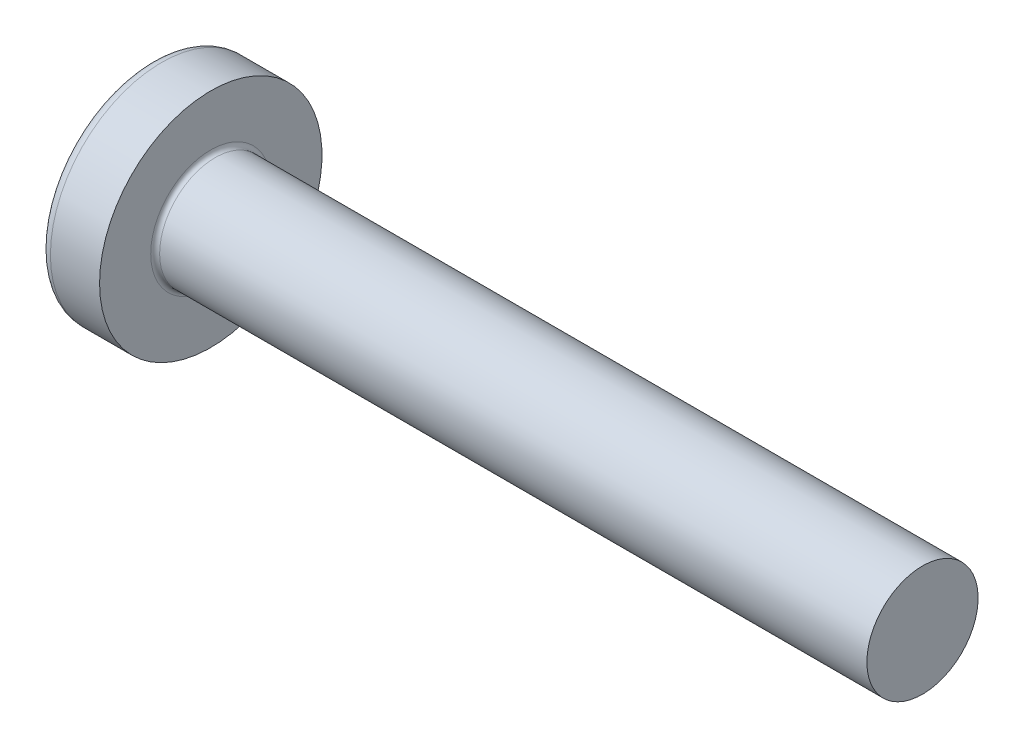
from build123d import *

# Parameters (mm, degrees)
FILLET1_R    = 0.1
RECPAT_COUNT = 2
RECPAT_ANGLE = 90


with BuildPart() as part:
    # BodySke → Base-Revolve (revolve)
    with BuildSketch(Plane.XY, mode=Mode.PRIVATE) as base_revolve_sk:
        with BuildLine():
            Line((2.1, 1.25), (2.1, 2.5))
            Line((2.1, 2.5), (0.99500416, 2.5))
            ThreePointArc((0.99500416, 2.5), (0.88781572, 2.474733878), (0.803195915, 2.404255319))
            ThreePointArc((0.803195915, 2.404255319), (0.206109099, 1.267435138), (0, 0))
            Line((0, 0), (18.1, 0))
            Line((18.1, 0), (18.1, 1.25))
            Line((18.1, 1.25), (2.1, 1.25))
        make_face()
    revolve(base_revolve_sk.sketch.rotate(Axis((0.99500416, 0, 0), (1, 0, 0)), 90), axis=Axis((0.99500416, 0, 0), (1, 0, 0)))

    # Fillet1
    fillet1_edges = [part.edges().sort_by_distance(p)[0] for p in [
        (2.1, 0, -1.25),
    ]]
    fillet(fillet1_edges, radius=FILLET1_R)

    # Sketch3 → Recess section 0
    with BuildSketch(Plane(origin=(0, 0, 0), x_dir=(0, 0, -1), z_dir=(1, 0, 0))):
        with BuildLine():
            Line((0.37, -1.3), (-0.37, -1.3))
            Line((-0.37, -1.3), (-0.37, 1.3))
            Line((-0.37, 1.3), (0.37, 1.3))
            Line((0.37, 1.3), (0.37, -1.3))
        make_face()
    # Sketch4 → Recess section 1
    with BuildSketch(Plane(origin=(1.5, 0, 0), x_dir=(0, 0, -1), z_dir=(1, 0, 0))):
        with BuildLine():
            Line((0.37, -0.552127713), (-0.37, -0.552127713))
            Line((-0.37, -0.552127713), (-0.37, 0.552127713))
            Line((-0.37, 0.552127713), (0.37, 0.552127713))
            Line((0.37, 0.552127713), (0.37, -0.552127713))
        make_face()
    recess = loft(mode=Mode.SUBTRACT)

    # RecPat: Recess ×2 about axis
    recpat_axis = Axis((0, 0, 0), (1, 0, 0))
    for i in range(1, RECPAT_COUNT):
        add(recess.rotate(recpat_axis, i * RECPAT_ANGLE / (RECPAT_COUNT - 1)), mode=Mode.SUBTRACT)

    # RecCorSke → RecessCore (revolve, cut)
    with BuildSketch(Plane.XY, mode=Mode.PRIVATE) as recesscore_sk:
        Polygon((0, 0), (0, 0.660890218), (1.5, 0.556), (1.680655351, 0), align=None)
    revolve(recesscore_sk.sketch.rotate(Axis((-3.175, 0, 0), (1, 0, 0)), 342.85413457), axis=Axis((-3.175, 0, 0), (1, 0, 0)), mode=Mode.SUBTRACT)


solid = part.part
